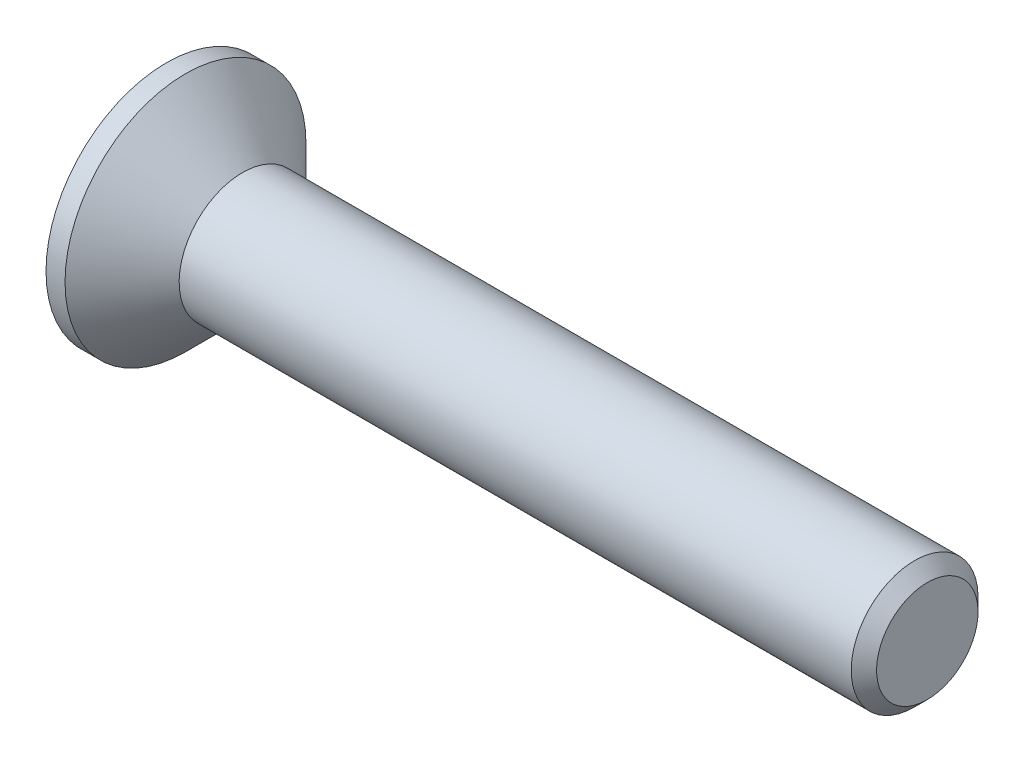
from build123d import *

# Parameters (mm, degrees)
CHAMFER1_SIZE      = 0.2
CUT_EXTRUDE1_DEPTH = 0.95


with BuildPart() as part:
    # Sketch1 → Revolve1 (revolve)
    with BuildSketch(Plane.XY, mode=Mode.PRIVATE) as revolve1_sk:
        Polygon((-1.2, 1.9), (-1.2, 0), (10.8, 0), (10.8, 1), (0, 1), (-0.9, 1.9), align=None)
    revolve(revolve1_sk.sketch.rotate(Axis((-1.2, 0, 0), (1, 0, 0)), 180), axis=Axis((-1.2, 0, 0), (1, 0, 0)))

    # Chamfer1
    chamfer1_edges = [part.edges().sort_by_distance(p)[0] for p in [
        (10.8, 1, 0),
    ]]
    chamfer(chamfer1_edges, length=CHAMFER1_SIZE)

    # Sketch2 → Cut-Extrude1 (cut)
    with BuildSketch(Plane.ZY.offset(1.2)):
        Polygon((-0.3, 1.175), (0.3, 1.175), (0.3, 0.3), (1.175, 0.3), (1.175, -0.3), (0.3, -0.3), (0.3, -1.175), (-0.3, -1.175), (-0.3, -0.3), (-1.175, -0.3), (-1.175, 0.3), (-0.3, 0.3), align=None)
    extrude(amount=-CUT_EXTRUDE1_DEPTH, mode=Mode.SUBTRACT)


solid = part.part
